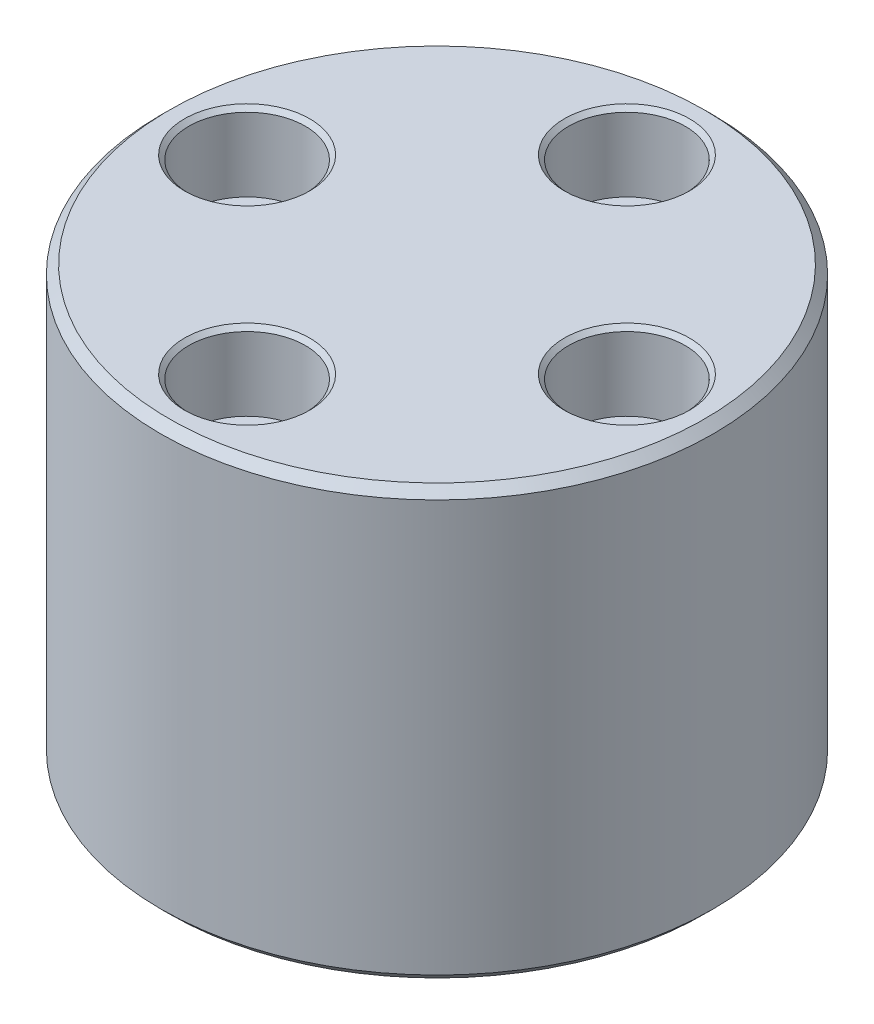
from build123d import *

# Parameters (mm, degrees)
SKETCH13_R                                       = 25.4
BOSS_EXTRUDE1_DEPTH                              = 39.4208
CBORE_FOR_1_4_SOCKET_HEAD_CAP_SCREW1_D           = 7.14248
CBORE_FOR_1_4_SOCKET_HEAD_CAP_SCREW1_CBORE_D     = 10.7188
CBORE_FOR_1_4_SOCKET_HEAD_CAP_SCREW1_CBORE_DEPTH = 7.14248
CHAMFER1_SIZE                                    = 0.79375
CHAMFER2_SIZE                                    = 0.396875


with BuildPart() as part:
    # Sketch13 → Boss-Extrude1 (new body)
    with BuildSketch(Plane(origin=(0, 0, 0), x_dir=(1, 0, 0), z_dir=(0, 1, 0))):
        with Locations(Location((0, 0, 0), (0, 0, 270))):
            Circle(SKETCH13_R)
    extrude(amount=BOSS_EXTRUDE1_DEPTH)

    # CBORE for 1_4 Socket Head Cap Screw1 (through all)
    with Locations(Plane(origin=(0, 39.4208, 0), x_dir=(1, 0, 0), z_dir=(0, 1, 0))):
        with Locations((0, 17.4625), (0, -17.4625), (-17.4625, 0), (17.4625, 0)):
            CounterBoreHole(CBORE_FOR_1_4_SOCKET_HEAD_CAP_SCREW1_D / 2, CBORE_FOR_1_4_SOCKET_HEAD_CAP_SCREW1_CBORE_D / 2, CBORE_FOR_1_4_SOCKET_HEAD_CAP_SCREW1_CBORE_DEPTH)

    # Chamfer1
    chamfer1_edges = [part.edges().sort_by_distance(p)[0] for p in [
        (0, 0, -25.4),
        (0, 39.4208, -25.4),
    ]]
    chamfer(chamfer1_edges, length=CHAMFER1_SIZE)

    # Chamfer2
    chamfer2_edges = [part.edges().sort_by_distance(p)[0] for p in [
        (-22.8219, 39.4208, 0),
        (-13.89126, 0, 0),
        (-5.3594, 39.4208, 17.4625),
        (3.57124, 0, 17.4625),
        (-5.3594, 39.4208, -17.4625),
        (3.57124, 0, -17.4625),
        (12.1031, 39.4208, 0),
        (21.03374, 0, 0),
    ]]
    chamfer(chamfer2_edges, length=CHAMFER2_SIZE)


solid = part.part
